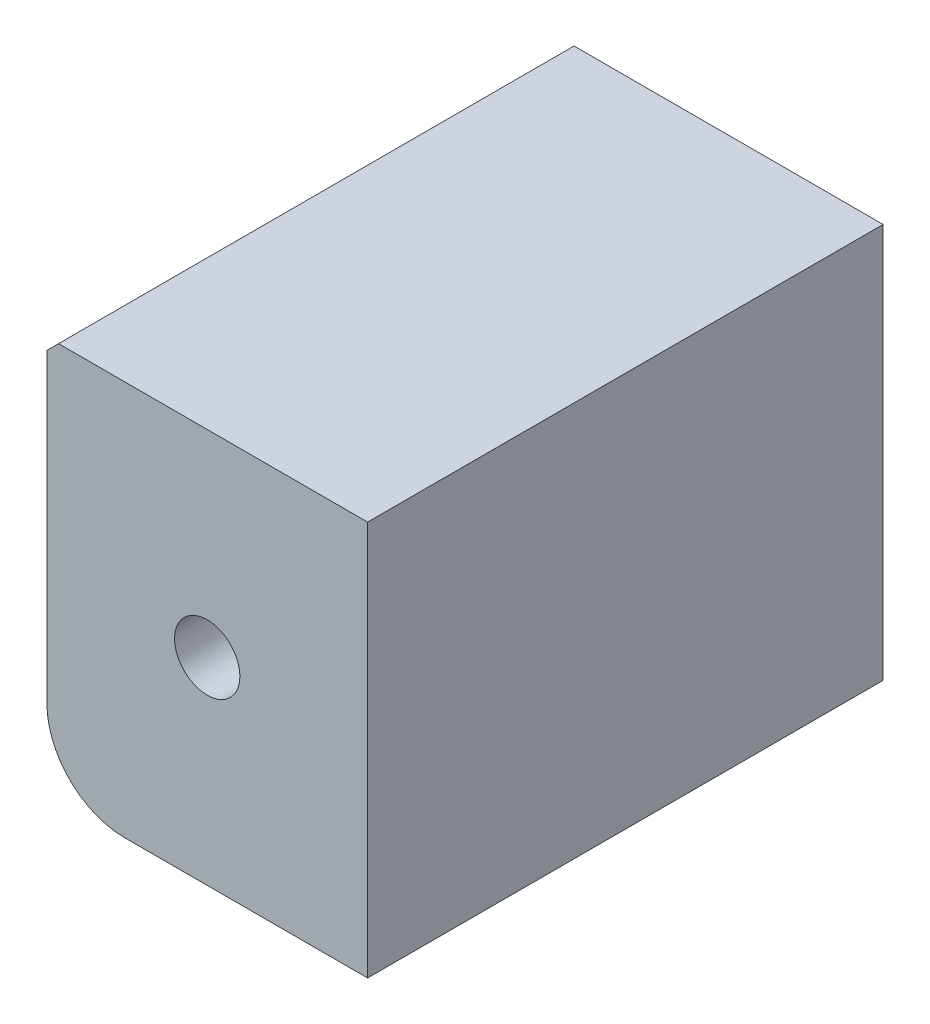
from build123d import *

# Parameters (mm, degrees)
EXTRUDE1_DEPTH     = 66.33
SKETCH2_R          = 4.2
CUT_EXTRUDE1_DEPTH = 22
CUT_EXTRUDE5_START = -22
SKETCH6_R          = 4.2
CUT_EXTRUDE5_DEPTH = 22
SKETCH8_R          = 9.01
CUT_EXTRUDE7_DEPTH = 8
SKETCH4_R          = 3
CUT_EXTRUDE8_DEPTH = 8
CHAMFER1_SIZE      = 1.5


with BuildPart() as part:
    # Sketch1 → Extrude1 (new body)
    with BuildSketch(Plane.XY):
        with BuildLine():
            Line((0, -50.8), (0, 0))
            Line((0, 0), (-41.27, 0))
            Line((-41.27, 0), (-41.27, -40.8))
            ThreePointArc((-41.27, -40.8), (-38.341067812, -47.871067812), (-31.27, -50.8))
            Line((-31.27, -50.8), (0, -50.8))
        make_face()
    extrude(amount=EXTRUDE1_DEPTH)

    # Sketch2 → Cut-Extrude1 (cut)
    with BuildSketch(Plane.XY.offset(66.33)):
        with Locations((-20.635, -25.4)):
            Circle(SKETCH2_R)
    extrude(amount=-CUT_EXTRUDE1_DEPTH, mode=Mode.SUBTRACT)

    # Sketch6 → Cut-Extrude5 (cut)
    with BuildSketch(Plane(origin=(0, 0, 0), x_dir=(-1, 0, 0), z_dir=(0, 0, -1)).offset(CUT_EXTRUDE5_START)):
        with Locations(Location((20.635, -25.4, 0), (0, 0, 180))):
            Circle(SKETCH6_R)
    extrude(amount=CUT_EXTRUDE5_DEPTH, mode=Mode.SUBTRACT)

    # Cut-Extrude6 cone 1 section (on through the dimple's axis) → Cut-Extrude6 (revolve, cut)
    with BuildSketch(Plane(origin=(-20.635, -25.4, 22), x_dir=(0, 1, 0), z_dir=(1, 0, 0))):
        Polygon((0, 0), (4.2, 0), (0, 2.424871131), align=None)
    revolve(axis=Axis((-20.635, -25.4, 22), (0, 0, 1)), mode=Mode.SUBTRACT)

    # Sketch8 → Cut-Extrude7 (cut)
    with BuildSketch(Plane(origin=(0, 0, 0), x_dir=(-1, 0, 0), z_dir=(0, 0, -1))):
        with Locations((20.635, -25.4)):
            Circle(SKETCH8_R)
    extrude(amount=-CUT_EXTRUDE7_DEPTH, mode=Mode.SUBTRACT)

    # Sketch4 → Cut-Extrude8 (cut)
    with BuildSketch(Plane(origin=(0, 0, 0), x_dir=(-1, 0, 0), z_dir=(0, 0, -1))):
        with Locations((20.635, -39.4)):
            Circle(SKETCH4_R)
    extrude(amount=-CUT_EXTRUDE8_DEPTH, mode=Mode.SUBTRACT)

    # Chamfer1
    chamfer1_edges = [part.edges().sort_by_distance(p)[0] for p in [
        (-41.27, 0, 33.165),
    ]]
    chamfer(chamfer1_edges, length=CHAMFER1_SIZE)


solid = part.part
